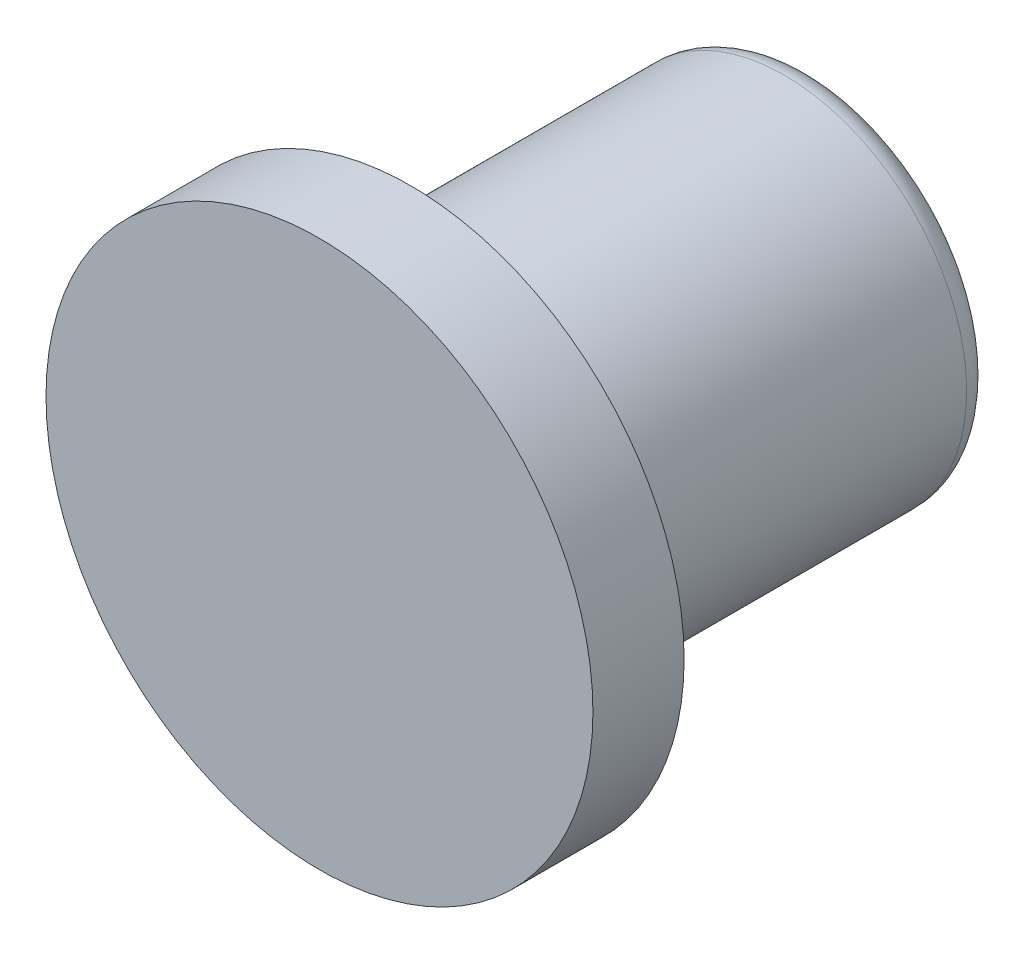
from build123d import *


with BuildPart() as part:
    # Sketch1 → Revolve1 (revolve)
    with BuildSketch(Plane(origin=(0, 0, 0), x_dir=(0, 0, -1), z_dir=(1, 0, 0)), mode=Mode.PRIVATE) as revolve1_sk:
        with BuildLine():
            Line((0, 0), (0, 15))
            Line((0, 15), (5, 15))
            Line((5, 15), (5, 10))
            Line((5, 10), (25.5, 10))
            ThreePointArc((25.5, 10), (26.560660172, 9.560660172), (27, 8.5))
            Line((27, 8.5), (27, 0))
            Line((27, 0), (0, 0))
        make_face()
    revolve(revolve1_sk.sketch.rotate(Axis((0, 0, 0), (0, 0, -1)), 90), axis=Axis((0, 0, 0), (0, 0, -1)))

    # Sketch3 → Cut-Revolve1 (revolve, cut)
    with BuildSketch(Plane(origin=(0, 0, 0), x_dir=(0, 0, -1), z_dir=(1, 0, 0))):
        Polygon((27, 3), (27, 0), (19.989934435, 0), (21, 2.5), (26.5, 2.5), align=None)
    revolve(axis=Axis((0, 0, -27), (0, 0, 1)), mode=Mode.SUBTRACT)


solid = part.part
